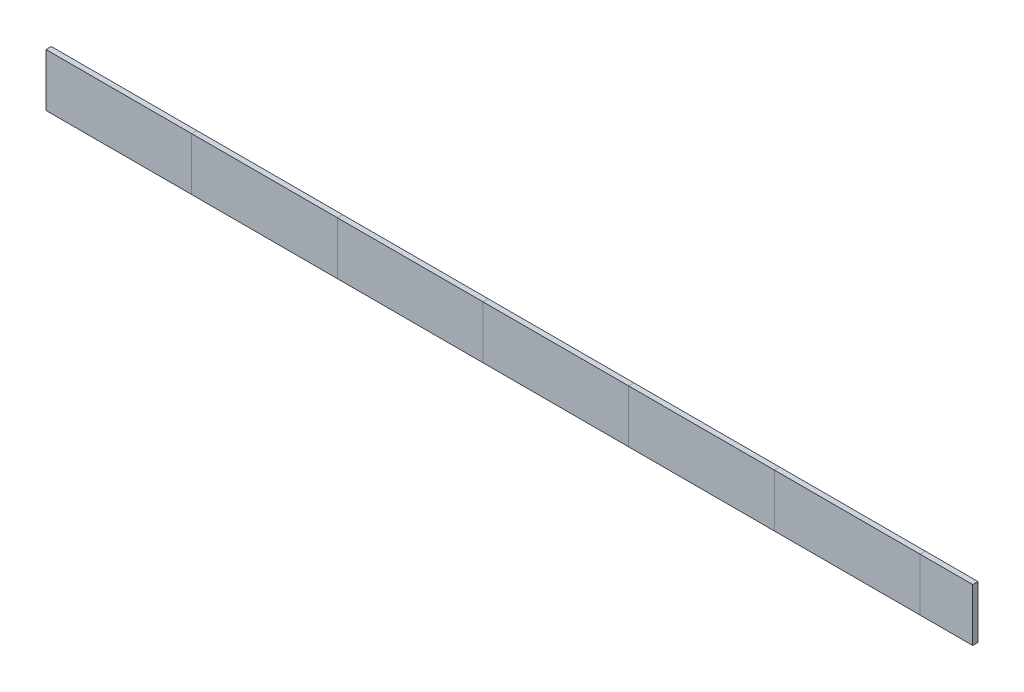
ISO-10303-21;
HEADER;
FILE_DESCRIPTION(('STEP AP214'),'2;1');
FILE_NAME('part.step','',(''),(''),'','','');
FILE_SCHEMA(('AUTOMOTIVE_DESIGN { 1 0 10303 214 1 1 1 1 }'));
ENDSEC;
DATA;
#1=APPLICATION_CONTEXT('core data for automotive mechanical design processes');
#2=APPLICATION_PROTOCOL_DEFINITION('international standard','automotive_design',2000,#1);
#3=PRODUCT_CONTEXT('',#1,'mechanical');
#4=PRODUCT('Part','Part','',(#3));
#5=PRODUCT_RELATED_PRODUCT_CATEGORY('part','',(#4));
#6=PRODUCT_DEFINITION_FORMATION('','',#4);
#7=PRODUCT_DEFINITION_CONTEXT('part definition',#1,'design');
#8=PRODUCT_DEFINITION('design','',#6,#7);
#9=PRODUCT_DEFINITION_SHAPE('','',#8);
#10=(LENGTH_UNIT() NAMED_UNIT(*) SI_UNIT(.MILLI.,.METRE.));
#11=(NAMED_UNIT(*) PLANE_ANGLE_UNIT() SI_UNIT($,.RADIAN.));
#12=(NAMED_UNIT(*) SI_UNIT($,.STERADIAN.) SOLID_ANGLE_UNIT());
#13=UNCERTAINTY_MEASURE_WITH_UNIT(LENGTH_MEASURE(1.E-05),#10,'distance_accuracy_value','');
#14=(GEOMETRIC_REPRESENTATION_CONTEXT(3) GLOBAL_UNCERTAINTY_ASSIGNED_CONTEXT((#13)) GLOBAL_UNIT_ASSIGNED_CONTEXT((#10,
#11,#12)) REPRESENTATION_CONTEXT('',''));
#15=CARTESIAN_POINT('',(0.,0.,0.));
#16=DIRECTION('',(0.,0.,1.));
#17=DIRECTION('',(1.,0.,0.));
#18=AXIS2_PLACEMENT_3D('',#15,#16,#17);
#19=CARTESIAN_POINT('',(0.,5.,0.));
#20=DIRECTION('',(0.,-1.,0.));
#21=DIRECTION('',(-1.,0.,0.));
#22=AXIS2_PLACEMENT_3D('',#19,#20,#21);
#23=PLANE('',#22);
#24=DIRECTION('',(0.,0.,1.));
#25=VECTOR('',#24,1.);
#26=CARTESIAN_POINT('',(27.6,5.,0.));
#27=LINE('',#26,#25);
#28=CARTESIAN_POINT('',(27.6,5.,-0.5));
#29=VERTEX_POINT('',#28);
#30=CARTESIAN_POINT('',(27.6,5.,0.5));
#31=VERTEX_POINT('',#30);
#32=EDGE_CURVE('E12',#29,#31,#27,.T.);
#33=ORIENTED_EDGE('',*,*,#32,.F.);
#34=DIRECTION('',(-1.,0.,0.));
#35=VECTOR('',#34,1.);
#36=CARTESIAN_POINT('',(0.,5.,-0.5));
#37=LINE('',#36,#35);
#38=CARTESIAN_POINT('',(0.,5.,-0.5));
#39=VERTEX_POINT('',#38);
#40=EDGE_CURVE('E110',#29,#39,#37,.T.);
#41=ORIENTED_EDGE('',*,*,#40,.T.);
#42=DIRECTION('',(0.,0.,1.));
#43=VECTOR('',#42,1.);
#44=CARTESIAN_POINT('',(0.,5.,0.));
#45=LINE('',#44,#43);
#46=CARTESIAN_POINT('',(0.,5.,0.5));
#47=VERTEX_POINT('',#46);
#48=EDGE_CURVE('E65',#39,#47,#45,.T.);
#49=ORIENTED_EDGE('',*,*,#48,.T.);
#50=DIRECTION('',(-1.,0.,0.));
#51=VECTOR('',#50,1.);
#52=CARTESIAN_POINT('',(0.,5.,0.5));
#53=LINE('',#52,#51);
#54=EDGE_CURVE('E123',#31,#47,#53,.T.);
#55=ORIENTED_EDGE('',*,*,#54,.F.);
#56=EDGE_LOOP('',(#33,#41,#49,#55));
#57=FACE_BOUND('',#56,.T.);
#58=ADVANCED_FACE('F55',(#57),#23,.F.);
#59=CARTESIAN_POINT('',(0.,0.,0.));
#60=DIRECTION('',(-1.,0.,0.));
#61=DIRECTION('',(0.,1.,0.));
#62=AXIS2_PLACEMENT_3D('',#59,#60,#61);
#63=PLANE('',#62);
#64=ORIENTED_EDGE('',*,*,#48,.F.);
#65=DIRECTION('',(0.,1.,0.));
#66=VECTOR('',#65,1.);
#67=CARTESIAN_POINT('',(0.,0.,-0.5));
#68=LINE('',#67,#66);
#69=CARTESIAN_POINT('',(0.,-5.,-0.5));
#70=VERTEX_POINT('',#69);
#71=EDGE_CURVE('E117',#39,#70,#68,.F.);
#72=ORIENTED_EDGE('',*,*,#71,.T.);
#73=DIRECTION('',(0.,0.,1.));
#74=VECTOR('',#73,1.);
#75=CARTESIAN_POINT('',(0.,-5.,0.));
#76=LINE('',#75,#74);
#77=CARTESIAN_POINT('',(0.,-5.,0.5));
#78=VERTEX_POINT('',#77);
#79=EDGE_CURVE('E73',#70,#78,#76,.T.);
#80=ORIENTED_EDGE('',*,*,#79,.T.);
#81=DIRECTION('',(0.,1.,0.));
#82=VECTOR('',#81,1.);
#83=CARTESIAN_POINT('',(0.,0.,0.5));
#84=LINE('',#83,#82);
#85=EDGE_CURVE('E104',#47,#78,#84,.F.);
#86=ORIENTED_EDGE('',*,*,#85,.F.);
#87=EDGE_LOOP('',(#64,#72,#80,#86));
#88=FACE_BOUND('',#87,.T.);
#89=ADVANCED_FACE('F127',(#88),#63,.T.);
#90=CARTESIAN_POINT('',(0.,-5.,0.));
#91=DIRECTION('',(0.,-1.,0.));
#92=DIRECTION('',(-1.,0.,0.));
#93=AXIS2_PLACEMENT_3D('',#90,#91,#92);
#94=PLANE('',#93);
#95=ORIENTED_EDGE('',*,*,#79,.F.);
#96=DIRECTION('',(-1.,0.,0.));
#97=VECTOR('',#96,1.);
#98=CARTESIAN_POINT('',(0.,-5.,-0.5));
#99=LINE('',#98,#97);
#100=CARTESIAN_POINT('',(27.6,-4.99999999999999,-0.5));
#101=VERTEX_POINT('',#100);
#102=EDGE_CURVE('E109',#70,#101,#99,.F.);
#103=ORIENTED_EDGE('',*,*,#102,.T.);
#104=DIRECTION('',(0.,0.,1.));
#105=VECTOR('',#104,1.);
#106=CARTESIAN_POINT('',(27.6,-4.99999999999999,0.));
#107=LINE('',#106,#105);
#108=CARTESIAN_POINT('',(27.6,-4.99999999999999,0.5));
#109=VERTEX_POINT('',#108);
#110=EDGE_CURVE('E59',#101,#109,#107,.T.);
#111=ORIENTED_EDGE('',*,*,#110,.T.);
#112=DIRECTION('',(-1.,0.,0.));
#113=VECTOR('',#112,1.);
#114=CARTESIAN_POINT('',(0.,-5.,0.5));
#115=LINE('',#114,#113);
#116=EDGE_CURVE('E119',#78,#109,#115,.F.);
#117=ORIENTED_EDGE('',*,*,#116,.F.);
#118=EDGE_LOOP('',(#95,#103,#111,#117));
#119=FACE_BOUND('',#118,.T.);
#120=ADVANCED_FACE('F112',(#119),#94,.T.);
#121=CARTESIAN_POINT('',(27.6,0.,0.));
#122=DIRECTION('',(-1.,0.,0.));
#123=DIRECTION('',(0.,1.,0.));
#124=AXIS2_PLACEMENT_3D('',#121,#122,#123);
#125=PLANE('',#124);
#126=DIRECTION('',(0.,1.,0.));
#127=VECTOR('',#126,1.);
#128=CARTESIAN_POINT('',(27.6,0.,-0.5));
#129=LINE('',#128,#127);
#130=EDGE_CURVE('E98',#101,#29,#129,.T.);
#131=ORIENTED_EDGE('',*,*,#130,.T.);
#132=ORIENTED_EDGE('',*,*,#32,.T.);
#133=DIRECTION('',(0.,1.,0.));
#134=VECTOR('',#133,1.);
#135=CARTESIAN_POINT('',(27.6,0.,0.5));
#136=LINE('',#135,#134);
#137=EDGE_CURVE('E100',#109,#31,#136,.T.);
#138=ORIENTED_EDGE('',*,*,#137,.F.);
#139=ORIENTED_EDGE('',*,*,#110,.F.);
#140=EDGE_LOOP('',(#131,#132,#138,#139));
#141=FACE_BOUND('',#140,.T.);
#142=ADVANCED_FACE('F57',(#141),#125,.F.);
#143=CARTESIAN_POINT('',(0.,0.,0.5));
#144=DIRECTION('',(0.,0.,-1.));
#145=DIRECTION('',(-1.,0.,0.));
#146=AXIS2_PLACEMENT_3D('',#143,#144,#145);
#147=PLANE('',#146);
#148=ORIENTED_EDGE('',*,*,#116,.T.);
#149=ORIENTED_EDGE('',*,*,#137,.T.);
#150=ORIENTED_EDGE('',*,*,#54,.T.);
#151=ORIENTED_EDGE('',*,*,#85,.T.);
#152=EDGE_LOOP('',(#148,#149,#150,#151));
#153=FACE_BOUND('',#152,.T.);
#154=ADVANCED_FACE('F126',(#153),#147,.F.);
#155=CARTESIAN_POINT('',(0.,0.,-0.5));
#156=DIRECTION('',(0.,0.,-1.));
#157=DIRECTION('',(-1.,0.,0.));
#158=AXIS2_PLACEMENT_3D('',#155,#156,#157);
#159=PLANE('',#158);
#160=ORIENTED_EDGE('',*,*,#102,.F.);
#161=ORIENTED_EDGE('',*,*,#71,.F.);
#162=ORIENTED_EDGE('',*,*,#40,.F.);
#163=ORIENTED_EDGE('',*,*,#130,.F.);
#164=EDGE_LOOP('',(#160,#161,#162,#163));
#165=FACE_BOUND('',#164,.T.);
#166=ADVANCED_FACE('F107',(#165),#159,.T.);
#167=CLOSED_SHELL('',(#58,#89,#120,#142,#154,#166));
#168=MANIFOLD_SOLID_BREP('B2',#167);
#169=CARTESIAN_POINT('',(0.,5.,0.));
#170=DIRECTION('',(0.,-1.,0.));
#171=DIRECTION('',(-1.,0.,0.));
#172=AXIS2_PLACEMENT_3D('',#169,#170,#171);
#173=PLANE('',#172);
#174=DIRECTION('',(0.,0.,1.));
#175=VECTOR('',#174,1.);
#176=CARTESIAN_POINT('',(165.6,5.,0.));
#177=LINE('',#176,#175);
#178=CARTESIAN_POINT('',(165.6,5.,-0.5));
#179=VERTEX_POINT('',#178);
#180=CARTESIAN_POINT('',(165.6,5.,0.5));
#181=VERTEX_POINT('',#180);
#182=EDGE_CURVE('E53',#179,#181,#177,.T.);
#183=ORIENTED_EDGE('',*,*,#182,.F.);
#184=DIRECTION('',(-1.,0.,0.));
#185=VECTOR('',#184,1.);
#186=CARTESIAN_POINT('',(0.,5.,-0.5));
#187=LINE('',#186,#185);
#188=CARTESIAN_POINT('',(138.,5.,-0.5));
#189=VERTEX_POINT('',#188);
#190=EDGE_CURVE('E243',#179,#189,#187,.T.);
#191=ORIENTED_EDGE('',*,*,#190,.T.);
#192=DIRECTION('',(0.,0.,1.));
#193=VECTOR('',#192,1.);
#194=CARTESIAN_POINT('',(138.,5.,0.));
#195=LINE('',#194,#193);
#196=CARTESIAN_POINT('',(138.,5.,0.5));
#197=VERTEX_POINT('',#196);
#198=EDGE_CURVE('E198',#189,#197,#195,.T.);
#199=ORIENTED_EDGE('',*,*,#198,.T.);
#200=DIRECTION('',(-1.,0.,0.));
#201=VECTOR('',#200,1.);
#202=CARTESIAN_POINT('',(0.,5.,0.5));
#203=LINE('',#202,#201);
#204=EDGE_CURVE('E256',#181,#197,#203,.T.);
#205=ORIENTED_EDGE('',*,*,#204,.F.);
#206=EDGE_LOOP('',(#183,#191,#199,#205));
#207=FACE_BOUND('',#206,.T.);
#208=ADVANCED_FACE('F188',(#207),#173,.F.);
#209=CARTESIAN_POINT('',(138.,0.,0.));
#210=DIRECTION('',(-1.,0.,0.));
#211=DIRECTION('',(0.,1.,0.));
#212=AXIS2_PLACEMENT_3D('',#209,#210,#211);
#213=PLANE('',#212);
#214=ORIENTED_EDGE('',*,*,#198,.F.);
#215=DIRECTION('',(0.,1.,0.));
#216=VECTOR('',#215,1.);
#217=CARTESIAN_POINT('',(138.,0.,-0.5));
#218=LINE('',#217,#216);
#219=CARTESIAN_POINT('',(138.,-4.99999999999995,-0.5));
#220=VERTEX_POINT('',#219);
#221=EDGE_CURVE('E250',#220,#189,#218,.T.);
#222=ORIENTED_EDGE('',*,*,#221,.F.);
#223=DIRECTION('',(0.,0.,1.));
#224=VECTOR('',#223,1.);
#225=CARTESIAN_POINT('',(138.,-4.99999999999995,0.));
#226=LINE('',#225,#224);
#227=CARTESIAN_POINT('',(138.,-4.99999999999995,0.5));
#228=VERTEX_POINT('',#227);
#229=EDGE_CURVE('E206',#220,#228,#226,.T.);
#230=ORIENTED_EDGE('',*,*,#229,.T.);
#231=DIRECTION('',(0.,1.,0.));
#232=VECTOR('',#231,1.);
#233=CARTESIAN_POINT('',(138.,0.,0.5));
#234=LINE('',#233,#232);
#235=EDGE_CURVE('E237',#228,#197,#234,.T.);
#236=ORIENTED_EDGE('',*,*,#235,.T.);
#237=EDGE_LOOP('',(#214,#222,#230,#236));
#238=FACE_BOUND('',#237,.T.);
#239=ADVANCED_FACE('F260',(#238),#213,.T.);
#240=CARTESIAN_POINT('',(0.,-4.99999999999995,0.));
#241=DIRECTION('',(0.,-1.,0.));
#242=DIRECTION('',(-1.,0.,0.));
#243=AXIS2_PLACEMENT_3D('',#240,#241,#242);
#244=PLANE('',#243);
#245=ORIENTED_EDGE('',*,*,#229,.F.);
#246=DIRECTION('',(-1.,0.,0.));
#247=VECTOR('',#246,1.);
#248=CARTESIAN_POINT('',(0.,-4.99999999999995,-0.5));
#249=LINE('',#248,#247);
#250=CARTESIAN_POINT('',(165.6,-4.99999999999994,-0.5));
#251=VERTEX_POINT('',#250);
#252=EDGE_CURVE('E242',#220,#251,#249,.F.);
#253=ORIENTED_EDGE('',*,*,#252,.T.);
#254=DIRECTION('',(0.,0.,1.));
#255=VECTOR('',#254,1.);
#256=CARTESIAN_POINT('',(165.6,-4.99999999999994,0.));
#257=LINE('',#256,#255);
#258=CARTESIAN_POINT('',(165.6,-4.99999999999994,0.5));
#259=VERTEX_POINT('',#258);
#260=EDGE_CURVE('E192',#251,#259,#257,.T.);
#261=ORIENTED_EDGE('',*,*,#260,.T.);
#262=DIRECTION('',(-1.,0.,0.));
#263=VECTOR('',#262,1.);
#264=CARTESIAN_POINT('',(0.,-4.99999999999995,0.5));
#265=LINE('',#264,#263);
#266=EDGE_CURVE('E252',#228,#259,#265,.F.);
#267=ORIENTED_EDGE('',*,*,#266,.F.);
#268=EDGE_LOOP('',(#245,#253,#261,#267));
#269=FACE_BOUND('',#268,.T.);
#270=ADVANCED_FACE('F245',(#269),#244,.T.);
#271=CARTESIAN_POINT('',(165.6,0.,0.));
#272=DIRECTION('',(-1.,0.,0.));
#273=DIRECTION('',(0.,1.,0.));
#274=AXIS2_PLACEMENT_3D('',#271,#272,#273);
#275=PLANE('',#274);
#276=DIRECTION('',(0.,1.,0.));
#277=VECTOR('',#276,1.);
#278=CARTESIAN_POINT('',(165.6,0.,-0.5));
#279=LINE('',#278,#277);
#280=EDGE_CURVE('E231',#251,#179,#279,.T.);
#281=ORIENTED_EDGE('',*,*,#280,.T.);
#282=ORIENTED_EDGE('',*,*,#182,.T.);
#283=DIRECTION('',(0.,1.,0.));
#284=VECTOR('',#283,1.);
#285=CARTESIAN_POINT('',(165.6,0.,0.5));
#286=LINE('',#285,#284);
#287=EDGE_CURVE('E233',#259,#181,#286,.T.);
#288=ORIENTED_EDGE('',*,*,#287,.F.);
#289=ORIENTED_EDGE('',*,*,#260,.F.);
#290=EDGE_LOOP('',(#281,#282,#288,#289));
#291=FACE_BOUND('',#290,.T.);
#292=ADVANCED_FACE('F190',(#291),#275,.F.);
#293=CARTESIAN_POINT('',(0.,0.,0.5));
#294=DIRECTION('',(0.,0.,-1.));
#295=DIRECTION('',(-1.,0.,0.));
#296=AXIS2_PLACEMENT_3D('',#293,#294,#295);
#297=PLANE('',#296);
#298=ORIENTED_EDGE('',*,*,#266,.T.);
#299=ORIENTED_EDGE('',*,*,#287,.T.);
#300=ORIENTED_EDGE('',*,*,#204,.T.);
#301=ORIENTED_EDGE('',*,*,#235,.F.);
#302=EDGE_LOOP('',(#298,#299,#300,#301));
#303=FACE_BOUND('',#302,.T.);
#304=ADVANCED_FACE('F259',(#303),#297,.F.);
#305=CARTESIAN_POINT('',(0.,0.,-0.5));
#306=DIRECTION('',(0.,0.,-1.));
#307=DIRECTION('',(-1.,0.,0.));
#308=AXIS2_PLACEMENT_3D('',#305,#306,#307);
#309=PLANE('',#308);
#310=ORIENTED_EDGE('',*,*,#252,.F.);
#311=ORIENTED_EDGE('',*,*,#221,.T.);
#312=ORIENTED_EDGE('',*,*,#190,.F.);
#313=ORIENTED_EDGE('',*,*,#280,.F.);
#314=EDGE_LOOP('',(#310,#311,#312,#313));
#315=FACE_BOUND('',#314,.T.);
#316=ADVANCED_FACE('F240',(#315),#309,.T.);
#317=CLOSED_SHELL('',(#208,#239,#270,#292,#304,#316));
#318=MANIFOLD_SOLID_BREP('B6',#317);
#319=CARTESIAN_POINT('',(0.,5.,0.));
#320=DIRECTION('',(0.,-1.,0.));
#321=DIRECTION('',(-1.,0.,0.));
#322=AXIS2_PLACEMENT_3D('',#319,#320,#321);
#323=PLANE('',#322);
#324=DIRECTION('',(0.,0.,1.));
#325=VECTOR('',#324,1.);
#326=CARTESIAN_POINT('',(110.4,5.,0.));
#327=LINE('',#326,#325);
#328=CARTESIAN_POINT('',(110.4,5.,-0.5));
#329=VERTEX_POINT('',#328);
#330=CARTESIAN_POINT('',(110.4,5.,0.5));
#331=VERTEX_POINT('',#330);
#332=EDGE_CURVE('E186',#329,#331,#327,.T.);
#333=ORIENTED_EDGE('',*,*,#332,.F.);
#334=DIRECTION('',(-1.,0.,0.));
#335=VECTOR('',#334,1.);
#336=CARTESIAN_POINT('',(0.,5.,-0.5));
#337=LINE('',#336,#335);
#338=CARTESIAN_POINT('',(82.8,5.,-0.5));
#339=VERTEX_POINT('',#338);
#340=EDGE_CURVE('E376',#329,#339,#337,.T.);
#341=ORIENTED_EDGE('',*,*,#340,.T.);
#342=DIRECTION('',(0.,0.,1.));
#343=VECTOR('',#342,1.);
#344=CARTESIAN_POINT('',(82.8,5.,0.));
#345=LINE('',#344,#343);
#346=CARTESIAN_POINT('',(82.8,5.,0.5));
#347=VERTEX_POINT('',#346);
#348=EDGE_CURVE('E331',#339,#347,#345,.T.);
#349=ORIENTED_EDGE('',*,*,#348,.T.);
#350=DIRECTION('',(-1.,0.,0.));
#351=VECTOR('',#350,1.);
#352=CARTESIAN_POINT('',(0.,5.,0.5));
#353=LINE('',#352,#351);
#354=EDGE_CURVE('E389',#331,#347,#353,.T.);
#355=ORIENTED_EDGE('',*,*,#354,.F.);
#356=EDGE_LOOP('',(#333,#341,#349,#355));
#357=FACE_BOUND('',#356,.T.);
#358=ADVANCED_FACE('F321',(#357),#323,.F.);
#359=CARTESIAN_POINT('',(82.8,0.,0.));
#360=DIRECTION('',(-1.,0.,0.));
#361=DIRECTION('',(0.,1.,0.));
#362=AXIS2_PLACEMENT_3D('',#359,#360,#361);
#363=PLANE('',#362);
#364=ORIENTED_EDGE('',*,*,#348,.F.);
#365=DIRECTION('',(0.,1.,0.));
#366=VECTOR('',#365,1.);
#367=CARTESIAN_POINT('',(82.8,0.,-0.5));
#368=LINE('',#367,#366);
#369=CARTESIAN_POINT('',(82.8,-4.99999999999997,-0.5));
#370=VERTEX_POINT('',#369);
#371=EDGE_CURVE('E383',#370,#339,#368,.T.);
#372=ORIENTED_EDGE('',*,*,#371,.F.);
#373=DIRECTION('',(0.,0.,1.));
#374=VECTOR('',#373,1.);
#375=CARTESIAN_POINT('',(82.8,-4.99999999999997,0.));
#376=LINE('',#375,#374);
#377=CARTESIAN_POINT('',(82.8,-4.99999999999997,0.5));
#378=VERTEX_POINT('',#377);
#379=EDGE_CURVE('E339',#370,#378,#376,.T.);
#380=ORIENTED_EDGE('',*,*,#379,.T.);
#381=DIRECTION('',(0.,1.,0.));
#382=VECTOR('',#381,1.);
#383=CARTESIAN_POINT('',(82.8,0.,0.5));
#384=LINE('',#383,#382);
#385=EDGE_CURVE('E370',#378,#347,#384,.T.);
#386=ORIENTED_EDGE('',*,*,#385,.T.);
#387=EDGE_LOOP('',(#364,#372,#380,#386));
#388=FACE_BOUND('',#387,.T.);
#389=ADVANCED_FACE('F393',(#388),#363,.T.);
#390=CARTESIAN_POINT('',(0.,-4.99999999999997,0.));
#391=DIRECTION('',(0.,-1.,0.));
#392=DIRECTION('',(-1.,0.,0.));
#393=AXIS2_PLACEMENT_3D('',#390,#391,#392);
#394=PLANE('',#393);
#395=ORIENTED_EDGE('',*,*,#379,.F.);
#396=DIRECTION('',(-1.,0.,0.));
#397=VECTOR('',#396,1.);
#398=CARTESIAN_POINT('',(0.,-4.99999999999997,-0.5));
#399=LINE('',#398,#397);
#400=CARTESIAN_POINT('',(110.4,-4.99999999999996,-0.5));
#401=VERTEX_POINT('',#400);
#402=EDGE_CURVE('E375',#370,#401,#399,.F.);
#403=ORIENTED_EDGE('',*,*,#402,.T.);
#404=DIRECTION('',(0.,0.,1.));
#405=VECTOR('',#404,1.);
#406=CARTESIAN_POINT('',(110.4,-4.99999999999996,0.));
#407=LINE('',#406,#405);
#408=CARTESIAN_POINT('',(110.4,-4.99999999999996,0.5));
#409=VERTEX_POINT('',#408);
#410=EDGE_CURVE('E325',#401,#409,#407,.T.);
#411=ORIENTED_EDGE('',*,*,#410,.T.);
#412=DIRECTION('',(-1.,0.,0.));
#413=VECTOR('',#412,1.);
#414=CARTESIAN_POINT('',(0.,-4.99999999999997,0.5));
#415=LINE('',#414,#413);
#416=EDGE_CURVE('E385',#378,#409,#415,.F.);
#417=ORIENTED_EDGE('',*,*,#416,.F.);
#418=EDGE_LOOP('',(#395,#403,#411,#417));
#419=FACE_BOUND('',#418,.T.);
#420=ADVANCED_FACE('F378',(#419),#394,.T.);
#421=CARTESIAN_POINT('',(110.4,0.,0.));
#422=DIRECTION('',(-1.,0.,0.));
#423=DIRECTION('',(0.,1.,0.));
#424=AXIS2_PLACEMENT_3D('',#421,#422,#423);
#425=PLANE('',#424);
#426=DIRECTION('',(0.,1.,0.));
#427=VECTOR('',#426,1.);
#428=CARTESIAN_POINT('',(110.4,0.,-0.5));
#429=LINE('',#428,#427);
#430=EDGE_CURVE('E364',#401,#329,#429,.T.);
#431=ORIENTED_EDGE('',*,*,#430,.T.);
#432=ORIENTED_EDGE('',*,*,#332,.T.);
#433=DIRECTION('',(0.,1.,0.));
#434=VECTOR('',#433,1.);
#435=CARTESIAN_POINT('',(110.4,0.,0.5));
#436=LINE('',#435,#434);
#437=EDGE_CURVE('E366',#409,#331,#436,.T.);
#438=ORIENTED_EDGE('',*,*,#437,.F.);
#439=ORIENTED_EDGE('',*,*,#410,.F.);
#440=EDGE_LOOP('',(#431,#432,#438,#439));
#441=FACE_BOUND('',#440,.T.);
#442=ADVANCED_FACE('F323',(#441),#425,.F.);
#443=CARTESIAN_POINT('',(0.,0.,0.5));
#444=DIRECTION('',(0.,0.,-1.));
#445=DIRECTION('',(-1.,0.,0.));
#446=AXIS2_PLACEMENT_3D('',#443,#444,#445);
#447=PLANE('',#446);
#448=ORIENTED_EDGE('',*,*,#416,.T.);
#449=ORIENTED_EDGE('',*,*,#437,.T.);
#450=ORIENTED_EDGE('',*,*,#354,.T.);
#451=ORIENTED_EDGE('',*,*,#385,.F.);
#452=EDGE_LOOP('',(#448,#449,#450,#451));
#453=FACE_BOUND('',#452,.T.);
#454=ADVANCED_FACE('F392',(#453),#447,.F.);
#455=CARTESIAN_POINT('',(0.,0.,-0.5));
#456=DIRECTION('',(0.,0.,-1.));
#457=DIRECTION('',(-1.,0.,0.));
#458=AXIS2_PLACEMENT_3D('',#455,#456,#457);
#459=PLANE('',#458);
#460=ORIENTED_EDGE('',*,*,#402,.F.);
#461=ORIENTED_EDGE('',*,*,#371,.T.);
#462=ORIENTED_EDGE('',*,*,#340,.F.);
#463=ORIENTED_EDGE('',*,*,#430,.F.);
#464=EDGE_LOOP('',(#460,#461,#462,#463));
#465=FACE_BOUND('',#464,.T.);
#466=ADVANCED_FACE('F373',(#465),#459,.T.);
#467=CLOSED_SHELL('',(#358,#389,#420,#442,#454,#466));
#468=MANIFOLD_SOLID_BREP('B47',#467);
#469=CARTESIAN_POINT('',(0.,5.,0.));
#470=DIRECTION('',(0.,-1.,0.));
#471=DIRECTION('',(-1.,0.,0.));
#472=AXIS2_PLACEMENT_3D('',#469,#470,#471);
#473=PLANE('',#472);
#474=DIRECTION('',(0.,0.,1.));
#475=VECTOR('',#474,1.);
#476=CARTESIAN_POINT('',(138.,5.,0.));
#477=LINE('',#476,#475);
#478=CARTESIAN_POINT('',(138.,5.,-0.5));
#479=VERTEX_POINT('',#478);
#480=CARTESIAN_POINT('',(138.,5.,0.5));
#481=VERTEX_POINT('',#480);
#482=EDGE_CURVE('E319',#479,#481,#477,.T.);
#483=ORIENTED_EDGE('',*,*,#482,.F.);
#484=DIRECTION('',(-1.,0.,0.));
#485=VECTOR('',#484,1.);
#486=CARTESIAN_POINT('',(0.,5.,-0.5));
#487=LINE('',#486,#485);
#488=CARTESIAN_POINT('',(110.4,5.,-0.5));
#489=VERTEX_POINT('',#488);
#490=EDGE_CURVE('E509',#479,#489,#487,.T.);
#491=ORIENTED_EDGE('',*,*,#490,.T.);
#492=DIRECTION('',(0.,0.,1.));
#493=VECTOR('',#492,1.);
#494=CARTESIAN_POINT('',(110.4,5.,0.));
#495=LINE('',#494,#493);
#496=CARTESIAN_POINT('',(110.4,5.,0.5));
#497=VERTEX_POINT('',#496);
#498=EDGE_CURVE('E464',#489,#497,#495,.T.);
#499=ORIENTED_EDGE('',*,*,#498,.T.);
#500=DIRECTION('',(-1.,0.,0.));
#501=VECTOR('',#500,1.);
#502=CARTESIAN_POINT('',(0.,5.,0.5));
#503=LINE('',#502,#501);
#504=EDGE_CURVE('E522',#481,#497,#503,.T.);
#505=ORIENTED_EDGE('',*,*,#504,.F.);
#506=EDGE_LOOP('',(#483,#491,#499,#505));
#507=FACE_BOUND('',#506,.T.);
#508=ADVANCED_FACE('F454',(#507),#473,.F.);
#509=CARTESIAN_POINT('',(110.4,0.,0.));
#510=DIRECTION('',(-1.,0.,0.));
#511=DIRECTION('',(0.,1.,0.));
#512=AXIS2_PLACEMENT_3D('',#509,#510,#511);
#513=PLANE('',#512);
#514=ORIENTED_EDGE('',*,*,#498,.F.);
#515=DIRECTION('',(0.,1.,0.));
#516=VECTOR('',#515,1.);
#517=CARTESIAN_POINT('',(110.4,0.,-0.5));
#518=LINE('',#517,#516);
#519=CARTESIAN_POINT('',(110.4,-4.99999999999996,-0.5));
#520=VERTEX_POINT('',#519);
#521=EDGE_CURVE('E516',#520,#489,#518,.T.);
#522=ORIENTED_EDGE('',*,*,#521,.F.);
#523=DIRECTION('',(0.,0.,1.));
#524=VECTOR('',#523,1.);
#525=CARTESIAN_POINT('',(110.4,-4.99999999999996,0.));
#526=LINE('',#525,#524);
#527=CARTESIAN_POINT('',(110.4,-4.99999999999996,0.5));
#528=VERTEX_POINT('',#527);
#529=EDGE_CURVE('E472',#520,#528,#526,.T.);
#530=ORIENTED_EDGE('',*,*,#529,.T.);
#531=DIRECTION('',(0.,1.,0.));
#532=VECTOR('',#531,1.);
#533=CARTESIAN_POINT('',(110.4,0.,0.5));
#534=LINE('',#533,#532);
#535=EDGE_CURVE('E503',#528,#497,#534,.T.);
#536=ORIENTED_EDGE('',*,*,#535,.T.);
#537=EDGE_LOOP('',(#514,#522,#530,#536));
#538=FACE_BOUND('',#537,.T.);
#539=ADVANCED_FACE('F526',(#538),#513,.T.);
#540=CARTESIAN_POINT('',(0.,-4.99999999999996,0.));
#541=DIRECTION('',(0.,-1.,0.));
#542=DIRECTION('',(-1.,0.,0.));
#543=AXIS2_PLACEMENT_3D('',#540,#541,#542);
#544=PLANE('',#543);
#545=ORIENTED_EDGE('',*,*,#529,.F.);
#546=DIRECTION('',(-1.,0.,0.));
#547=VECTOR('',#546,1.);
#548=CARTESIAN_POINT('',(0.,-4.99999999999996,-0.5));
#549=LINE('',#548,#547);
#550=CARTESIAN_POINT('',(138.,-4.99999999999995,-0.5));
#551=VERTEX_POINT('',#550);
#552=EDGE_CURVE('E508',#520,#551,#549,.F.);
#553=ORIENTED_EDGE('',*,*,#552,.T.);
#554=DIRECTION('',(0.,0.,1.));
#555=VECTOR('',#554,1.);
#556=CARTESIAN_POINT('',(138.,-4.99999999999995,0.));
#557=LINE('',#556,#555);
#558=CARTESIAN_POINT('',(138.,-4.99999999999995,0.5));
#559=VERTEX_POINT('',#558);
#560=EDGE_CURVE('E458',#551,#559,#557,.T.);
#561=ORIENTED_EDGE('',*,*,#560,.T.);
#562=DIRECTION('',(-1.,0.,0.));
#563=VECTOR('',#562,1.);
#564=CARTESIAN_POINT('',(0.,-4.99999999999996,0.5));
#565=LINE('',#564,#563);
#566=EDGE_CURVE('E518',#528,#559,#565,.F.);
#567=ORIENTED_EDGE('',*,*,#566,.F.);
#568=EDGE_LOOP('',(#545,#553,#561,#567));
#569=FACE_BOUND('',#568,.T.);
#570=ADVANCED_FACE('F511',(#569),#544,.T.);
#571=CARTESIAN_POINT('',(138.,0.,0.));
#572=DIRECTION('',(-1.,0.,0.));
#573=DIRECTION('',(0.,1.,0.));
#574=AXIS2_PLACEMENT_3D('',#571,#572,#573);
#575=PLANE('',#574);
#576=DIRECTION('',(0.,1.,0.));
#577=VECTOR('',#576,1.);
#578=CARTESIAN_POINT('',(138.,0.,-0.5));
#579=LINE('',#578,#577);
#580=EDGE_CURVE('E497',#551,#479,#579,.T.);
#581=ORIENTED_EDGE('',*,*,#580,.T.);
#582=ORIENTED_EDGE('',*,*,#482,.T.);
#583=DIRECTION('',(0.,1.,0.));
#584=VECTOR('',#583,1.);
#585=CARTESIAN_POINT('',(138.,0.,0.5));
#586=LINE('',#585,#584);
#587=EDGE_CURVE('E499',#559,#481,#586,.T.);
#588=ORIENTED_EDGE('',*,*,#587,.F.);
#589=ORIENTED_EDGE('',*,*,#560,.F.);
#590=EDGE_LOOP('',(#581,#582,#588,#589));
#591=FACE_BOUND('',#590,.T.);
#592=ADVANCED_FACE('F456',(#591),#575,.F.);
#593=CARTESIAN_POINT('',(0.,0.,0.5));
#594=DIRECTION('',(0.,0.,-1.));
#595=DIRECTION('',(-1.,0.,0.));
#596=AXIS2_PLACEMENT_3D('',#593,#594,#595);
#597=PLANE('',#596);
#598=ORIENTED_EDGE('',*,*,#566,.T.);
#599=ORIENTED_EDGE('',*,*,#587,.T.);
#600=ORIENTED_EDGE('',*,*,#504,.T.);
#601=ORIENTED_EDGE('',*,*,#535,.F.);
#602=EDGE_LOOP('',(#598,#599,#600,#601));
#603=FACE_BOUND('',#602,.T.);
#604=ADVANCED_FACE('F525',(#603),#597,.F.);
#605=CARTESIAN_POINT('',(0.,0.,-0.5));
#606=DIRECTION('',(0.,0.,-1.));
#607=DIRECTION('',(-1.,0.,0.));
#608=AXIS2_PLACEMENT_3D('',#605,#606,#607);
#609=PLANE('',#608);
#610=ORIENTED_EDGE('',*,*,#552,.F.);
#611=ORIENTED_EDGE('',*,*,#521,.T.);
#612=ORIENTED_EDGE('',*,*,#490,.F.);
#613=ORIENTED_EDGE('',*,*,#580,.F.);
#614=EDGE_LOOP('',(#610,#611,#612,#613));
#615=FACE_BOUND('',#614,.T.);
#616=ADVANCED_FACE('F506',(#615),#609,.T.);
#617=CLOSED_SHELL('',(#508,#539,#570,#592,#604,#616));
#618=MANIFOLD_SOLID_BREP('B180',#617);
#619=CARTESIAN_POINT('',(0.,5.,0.));
#620=DIRECTION('',(0.,-1.,0.));
#621=DIRECTION('',(-1.,0.,0.));
#622=AXIS2_PLACEMENT_3D('',#619,#620,#621);
#623=PLANE('',#622);
#624=DIRECTION('',(0.,0.,1.));
#625=VECTOR('',#624,1.);
#626=CARTESIAN_POINT('',(82.8,5.,0.));
#627=LINE('',#626,#625);
#628=CARTESIAN_POINT('',(82.8,5.,-0.5));
#629=VERTEX_POINT('',#628);
#630=CARTESIAN_POINT('',(82.8,5.,0.5));
#631=VERTEX_POINT('',#630);
#632=EDGE_CURVE('E452',#629,#631,#627,.T.);
#633=ORIENTED_EDGE('',*,*,#632,.F.);
#634=DIRECTION('',(-1.,0.,0.));
#635=VECTOR('',#634,1.);
#636=CARTESIAN_POINT('',(0.,5.,-0.5));
#637=LINE('',#636,#635);
#638=CARTESIAN_POINT('',(55.2,5.,-0.5));
#639=VERTEX_POINT('',#638);
#640=EDGE_CURVE('E642',#629,#639,#637,.T.);
#641=ORIENTED_EDGE('',*,*,#640,.T.);
#642=DIRECTION('',(0.,0.,1.));
#643=VECTOR('',#642,1.);
#644=CARTESIAN_POINT('',(55.2,5.,0.));
#645=LINE('',#644,#643);
#646=CARTESIAN_POINT('',(55.2,5.,0.5));
#647=VERTEX_POINT('',#646);
#648=EDGE_CURVE('E597',#639,#647,#645,.T.);
#649=ORIENTED_EDGE('',*,*,#648,.T.);
#650=DIRECTION('',(-1.,0.,0.));
#651=VECTOR('',#650,1.);
#652=CARTESIAN_POINT('',(0.,5.,0.5));
#653=LINE('',#652,#651);
#654=EDGE_CURVE('E655',#631,#647,#653,.T.);
#655=ORIENTED_EDGE('',*,*,#654,.F.);
#656=EDGE_LOOP('',(#633,#641,#649,#655));
#657=FACE_BOUND('',#656,.T.);
#658=ADVANCED_FACE('F587',(#657),#623,.F.);
#659=CARTESIAN_POINT('',(55.2,0.,0.));
#660=DIRECTION('',(-1.,0.,0.));
#661=DIRECTION('',(0.,1.,0.));
#662=AXIS2_PLACEMENT_3D('',#659,#660,#661);
#663=PLANE('',#662);
#664=ORIENTED_EDGE('',*,*,#648,.F.);
#665=DIRECTION('',(0.,1.,0.));
#666=VECTOR('',#665,1.);
#667=CARTESIAN_POINT('',(55.2,0.,-0.5));
#668=LINE('',#667,#666);
#669=CARTESIAN_POINT('',(55.2,-4.99999999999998,-0.5));
#670=VERTEX_POINT('',#669);
#671=EDGE_CURVE('E649',#670,#639,#668,.T.);
#672=ORIENTED_EDGE('',*,*,#671,.F.);
#673=DIRECTION('',(0.,0.,1.));
#674=VECTOR('',#673,1.);
#675=CARTESIAN_POINT('',(55.2,-4.99999999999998,0.));
#676=LINE('',#675,#674);
#677=CARTESIAN_POINT('',(55.2,-4.99999999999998,0.5));
#678=VERTEX_POINT('',#677);
#679=EDGE_CURVE('E605',#670,#678,#676,.T.);
#680=ORIENTED_EDGE('',*,*,#679,.T.);
#681=DIRECTION('',(0.,1.,0.));
#682=VECTOR('',#681,1.);
#683=CARTESIAN_POINT('',(55.2,0.,0.5));
#684=LINE('',#683,#682);
#685=EDGE_CURVE('E636',#678,#647,#684,.T.);
#686=ORIENTED_EDGE('',*,*,#685,.T.);
#687=EDGE_LOOP('',(#664,#672,#680,#686));
#688=FACE_BOUND('',#687,.T.);
#689=ADVANCED_FACE('F659',(#688),#663,.T.);
#690=CARTESIAN_POINT('',(0.,-4.99999999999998,0.));
#691=DIRECTION('',(0.,-1.,0.));
#692=DIRECTION('',(-1.,0.,0.));
#693=AXIS2_PLACEMENT_3D('',#690,#691,#692);
#694=PLANE('',#693);
#695=ORIENTED_EDGE('',*,*,#679,.F.);
#696=DIRECTION('',(-1.,0.,0.));
#697=VECTOR('',#696,1.);
#698=CARTESIAN_POINT('',(0.,-4.99999999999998,-0.5));
#699=LINE('',#698,#697);
#700=CARTESIAN_POINT('',(82.8,-4.99999999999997,-0.5));
#701=VERTEX_POINT('',#700);
#702=EDGE_CURVE('E641',#670,#701,#699,.F.);
#703=ORIENTED_EDGE('',*,*,#702,.T.);
#704=DIRECTION('',(0.,0.,1.));
#705=VECTOR('',#704,1.);
#706=CARTESIAN_POINT('',(82.8,-4.99999999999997,0.));
#707=LINE('',#706,#705);
#708=CARTESIAN_POINT('',(82.8,-4.99999999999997,0.5));
#709=VERTEX_POINT('',#708);
#710=EDGE_CURVE('E591',#701,#709,#707,.T.);
#711=ORIENTED_EDGE('',*,*,#710,.T.);
#712=DIRECTION('',(-1.,0.,0.));
#713=VECTOR('',#712,1.);
#714=CARTESIAN_POINT('',(0.,-4.99999999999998,0.5));
#715=LINE('',#714,#713);
#716=EDGE_CURVE('E651',#678,#709,#715,.F.);
#717=ORIENTED_EDGE('',*,*,#716,.F.);
#718=EDGE_LOOP('',(#695,#703,#711,#717));
#719=FACE_BOUND('',#718,.T.);
#720=ADVANCED_FACE('F644',(#719),#694,.T.);
#721=CARTESIAN_POINT('',(82.8,0.,0.));
#722=DIRECTION('',(-1.,0.,0.));
#723=DIRECTION('',(0.,1.,0.));
#724=AXIS2_PLACEMENT_3D('',#721,#722,#723);
#725=PLANE('',#724);
#726=DIRECTION('',(0.,1.,0.));
#727=VECTOR('',#726,1.);
#728=CARTESIAN_POINT('',(82.8,0.,-0.5));
#729=LINE('',#728,#727);
#730=EDGE_CURVE('E630',#701,#629,#729,.T.);
#731=ORIENTED_EDGE('',*,*,#730,.T.);
#732=ORIENTED_EDGE('',*,*,#632,.T.);
#733=DIRECTION('',(0.,1.,0.));
#734=VECTOR('',#733,1.);
#735=CARTESIAN_POINT('',(82.8,0.,0.5));
#736=LINE('',#735,#734);
#737=EDGE_CURVE('E632',#709,#631,#736,.T.);
#738=ORIENTED_EDGE('',*,*,#737,.F.);
#739=ORIENTED_EDGE('',*,*,#710,.F.);
#740=EDGE_LOOP('',(#731,#732,#738,#739));
#741=FACE_BOUND('',#740,.T.);
#742=ADVANCED_FACE('F589',(#741),#725,.F.);
#743=CARTESIAN_POINT('',(0.,0.,0.5));
#744=DIRECTION('',(0.,0.,-1.));
#745=DIRECTION('',(-1.,0.,0.));
#746=AXIS2_PLACEMENT_3D('',#743,#744,#745);
#747=PLANE('',#746);
#748=ORIENTED_EDGE('',*,*,#716,.T.);
#749=ORIENTED_EDGE('',*,*,#737,.T.);
#750=ORIENTED_EDGE('',*,*,#654,.T.);
#751=ORIENTED_EDGE('',*,*,#685,.F.);
#752=EDGE_LOOP('',(#748,#749,#750,#751));
#753=FACE_BOUND('',#752,.T.);
#754=ADVANCED_FACE('F658',(#753),#747,.F.);
#755=CARTESIAN_POINT('',(0.,0.,-0.5));
#756=DIRECTION('',(0.,0.,-1.));
#757=DIRECTION('',(-1.,0.,0.));
#758=AXIS2_PLACEMENT_3D('',#755,#756,#757);
#759=PLANE('',#758);
#760=ORIENTED_EDGE('',*,*,#702,.F.);
#761=ORIENTED_EDGE('',*,*,#671,.T.);
#762=ORIENTED_EDGE('',*,*,#640,.F.);
#763=ORIENTED_EDGE('',*,*,#730,.F.);
#764=EDGE_LOOP('',(#760,#761,#762,#763));
#765=FACE_BOUND('',#764,.T.);
#766=ADVANCED_FACE('F639',(#765),#759,.T.);
#767=CLOSED_SHELL('',(#658,#689,#720,#742,#754,#766));
#768=MANIFOLD_SOLID_BREP('B313',#767);
#769=CARTESIAN_POINT('',(175.6,0.,0.));
#770=DIRECTION('',(-1.,0.,0.));
#771=DIRECTION('',(0.,1.,0.));
#772=AXIS2_PLACEMENT_3D('',#769,#770,#771);
#773=PLANE('',#772);
#774=DIRECTION('',(0.,0.,1.));
#775=VECTOR('',#774,1.);
#776=CARTESIAN_POINT('',(175.6,-4.99999999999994,0.));
#777=LINE('',#776,#775);
#778=CARTESIAN_POINT('',(175.6,-4.99999999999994,-0.5));
#779=VERTEX_POINT('',#778);
#780=CARTESIAN_POINT('',(175.6,-4.99999999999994,0.5));
#781=VERTEX_POINT('',#780);
#782=EDGE_CURVE('E585',#779,#781,#777,.T.);
#783=ORIENTED_EDGE('',*,*,#782,.F.);
#784=DIRECTION('',(0.,1.,0.));
#785=VECTOR('',#784,1.);
#786=CARTESIAN_POINT('',(175.6,0.,-0.5));
#787=LINE('',#786,#785);
#788=CARTESIAN_POINT('',(175.6,5.,-0.5));
#789=VERTEX_POINT('',#788);
#790=EDGE_CURVE('E775',#779,#789,#787,.T.);
#791=ORIENTED_EDGE('',*,*,#790,.T.);
#792=DIRECTION('',(0.,0.,1.));
#793=VECTOR('',#792,1.);
#794=CARTESIAN_POINT('',(175.6,5.,0.));
#795=LINE('',#794,#793);
#796=CARTESIAN_POINT('',(175.6,5.,0.5));
#797=VERTEX_POINT('',#796);
#798=EDGE_CURVE('E730',#789,#797,#795,.T.);
#799=ORIENTED_EDGE('',*,*,#798,.T.);
#800=DIRECTION('',(0.,1.,0.));
#801=VECTOR('',#800,1.);
#802=CARTESIAN_POINT('',(175.6,0.,0.5));
#803=LINE('',#802,#801);
#804=EDGE_CURVE('E788',#781,#797,#803,.T.);
#805=ORIENTED_EDGE('',*,*,#804,.F.);
#806=EDGE_LOOP('',(#783,#791,#799,#805));
#807=FACE_BOUND('',#806,.T.);
#808=ADVANCED_FACE('F720',(#807),#773,.F.);
#809=CARTESIAN_POINT('',(0.,5.,0.));
#810=DIRECTION('',(0.,-1.,0.));
#811=DIRECTION('',(-1.,0.,0.));
#812=AXIS2_PLACEMENT_3D('',#809,#810,#811);
#813=PLANE('',#812);
#814=ORIENTED_EDGE('',*,*,#798,.F.);
#815=DIRECTION('',(-1.,0.,0.));
#816=VECTOR('',#815,1.);
#817=CARTESIAN_POINT('',(0.,5.,-0.5));
#818=LINE('',#817,#816);
#819=CARTESIAN_POINT('',(165.6,5.,-0.5));
#820=VERTEX_POINT('',#819);
#821=EDGE_CURVE('E782',#789,#820,#818,.T.);
#822=ORIENTED_EDGE('',*,*,#821,.T.);
#823=DIRECTION('',(0.,0.,1.));
#824=VECTOR('',#823,1.);
#825=CARTESIAN_POINT('',(165.6,5.,0.));
#826=LINE('',#825,#824);
#827=CARTESIAN_POINT('',(165.6,5.,0.5));
#828=VERTEX_POINT('',#827);
#829=EDGE_CURVE('E738',#820,#828,#826,.T.);
#830=ORIENTED_EDGE('',*,*,#829,.T.);
#831=DIRECTION('',(-1.,0.,0.));
#832=VECTOR('',#831,1.);
#833=CARTESIAN_POINT('',(0.,5.,0.5));
#834=LINE('',#833,#832);
#835=EDGE_CURVE('E769',#797,#828,#834,.T.);
#836=ORIENTED_EDGE('',*,*,#835,.F.);
#837=EDGE_LOOP('',(#814,#822,#830,#836));
#838=FACE_BOUND('',#837,.T.);
#839=ADVANCED_FACE('F792',(#838),#813,.F.);
#840=CARTESIAN_POINT('',(165.6,0.,0.));
#841=DIRECTION('',(-1.,0.,0.));
#842=DIRECTION('',(0.,1.,0.));
#843=AXIS2_PLACEMENT_3D('',#840,#841,#842);
#844=PLANE('',#843);
#845=ORIENTED_EDGE('',*,*,#829,.F.);
#846=DIRECTION('',(0.,1.,0.));
#847=VECTOR('',#846,1.);
#848=CARTESIAN_POINT('',(165.6,0.,-0.5));
#849=LINE('',#848,#847);
#850=CARTESIAN_POINT('',(165.6,-4.99999999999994,-0.5));
#851=VERTEX_POINT('',#850);
#852=EDGE_CURVE('E774',#851,#820,#849,.T.);
#853=ORIENTED_EDGE('',*,*,#852,.F.);
#854=DIRECTION('',(0.,0.,1.));
#855=VECTOR('',#854,1.);
#856=CARTESIAN_POINT('',(165.6,-4.99999999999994,0.));
#857=LINE('',#856,#855);
#858=CARTESIAN_POINT('',(165.6,-4.99999999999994,0.5));
#859=VERTEX_POINT('',#858);
#860=EDGE_CURVE('E724',#851,#859,#857,.T.);
#861=ORIENTED_EDGE('',*,*,#860,.T.);
#862=DIRECTION('',(0.,1.,0.));
#863=VECTOR('',#862,1.);
#864=CARTESIAN_POINT('',(165.6,0.,0.5));
#865=LINE('',#864,#863);
#866=EDGE_CURVE('E784',#859,#828,#865,.T.);
#867=ORIENTED_EDGE('',*,*,#866,.T.);
#868=EDGE_LOOP('',(#845,#853,#861,#867));
#869=FACE_BOUND('',#868,.T.);
#870=ADVANCED_FACE('F777',(#869),#844,.T.);
#871=CARTESIAN_POINT('',(0.,-4.99999999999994,0.));
#872=DIRECTION('',(0.,-1.,0.));
#873=DIRECTION('',(-1.,0.,0.));
#874=AXIS2_PLACEMENT_3D('',#871,#872,#873);
#875=PLANE('',#874);
#876=DIRECTION('',(-1.,0.,0.));
#877=VECTOR('',#876,1.);
#878=CARTESIAN_POINT('',(0.,-4.99999999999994,-0.5));
#879=LINE('',#878,#877);
#880=EDGE_CURVE('E763',#851,#779,#879,.F.);
#881=ORIENTED_EDGE('',*,*,#880,.T.);
#882=ORIENTED_EDGE('',*,*,#782,.T.);
#883=DIRECTION('',(-1.,0.,0.));
#884=VECTOR('',#883,1.);
#885=CARTESIAN_POINT('',(0.,-4.99999999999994,0.5));
#886=LINE('',#885,#884);
#887=EDGE_CURVE('E765',#859,#781,#886,.F.);
#888=ORIENTED_EDGE('',*,*,#887,.F.);
#889=ORIENTED_EDGE('',*,*,#860,.F.);
#890=EDGE_LOOP('',(#881,#882,#888,#889));
#891=FACE_BOUND('',#890,.T.);
#892=ADVANCED_FACE('F722',(#891),#875,.T.);
#893=CARTESIAN_POINT('',(0.,0.,0.5));
#894=DIRECTION('',(0.,0.,-1.));
#895=DIRECTION('',(-1.,0.,0.));
#896=AXIS2_PLACEMENT_3D('',#893,#894,#895);
#897=PLANE('',#896);
#898=ORIENTED_EDGE('',*,*,#866,.F.);
#899=ORIENTED_EDGE('',*,*,#887,.T.);
#900=ORIENTED_EDGE('',*,*,#804,.T.);
#901=ORIENTED_EDGE('',*,*,#835,.T.);
#902=EDGE_LOOP('',(#898,#899,#900,#901));
#903=FACE_BOUND('',#902,.T.);
#904=ADVANCED_FACE('F791',(#903),#897,.F.);
#905=CARTESIAN_POINT('',(0.,0.,-0.5));
#906=DIRECTION('',(0.,0.,-1.));
#907=DIRECTION('',(-1.,0.,0.));
#908=AXIS2_PLACEMENT_3D('',#905,#906,#907);
#909=PLANE('',#908);
#910=ORIENTED_EDGE('',*,*,#852,.T.);
#911=ORIENTED_EDGE('',*,*,#821,.F.);
#912=ORIENTED_EDGE('',*,*,#790,.F.);
#913=ORIENTED_EDGE('',*,*,#880,.F.);
#914=EDGE_LOOP('',(#910,#911,#912,#913));
#915=FACE_BOUND('',#914,.T.);
#916=ADVANCED_FACE('F772',(#915),#909,.T.);
#917=CLOSED_SHELL('',(#808,#839,#870,#892,#904,#916));
#918=MANIFOLD_SOLID_BREP('B446',#917);
#919=CARTESIAN_POINT('',(0.,5.,0.));
#920=DIRECTION('',(0.,-1.,0.));
#921=DIRECTION('',(-1.,0.,0.));
#922=AXIS2_PLACEMENT_3D('',#919,#920,#921);
#923=PLANE('',#922);
#924=DIRECTION('',(0.,0.,1.));
#925=VECTOR('',#924,1.);
#926=CARTESIAN_POINT('',(55.2,5.,0.));
#927=LINE('',#926,#925);
#928=CARTESIAN_POINT('',(55.2,5.,-0.5));
#929=VERTEX_POINT('',#928);
#930=CARTESIAN_POINT('',(55.2,5.,0.5));
#931=VERTEX_POINT('',#930);
#932=EDGE_CURVE('E718',#929,#931,#927,.T.);
#933=ORIENTED_EDGE('',*,*,#932,.F.);
#934=DIRECTION('',(-1.,0.,0.));
#935=VECTOR('',#934,1.);
#936=CARTESIAN_POINT('',(0.,5.,-0.5));
#937=LINE('',#936,#935);
#938=CARTESIAN_POINT('',(27.6,5.,-0.5));
#939=VERTEX_POINT('',#938);
#940=EDGE_CURVE('E907',#929,#939,#937,.T.);
#941=ORIENTED_EDGE('',*,*,#940,.T.);
#942=DIRECTION('',(0.,0.,1.));
#943=VECTOR('',#942,1.);
#944=CARTESIAN_POINT('',(27.6,5.,0.));
#945=LINE('',#944,#943);
#946=CARTESIAN_POINT('',(27.6,5.,0.5));
#947=VERTEX_POINT('',#946);
#948=EDGE_CURVE('E862',#939,#947,#945,.T.);
#949=ORIENTED_EDGE('',*,*,#948,.T.);
#950=DIRECTION('',(-1.,0.,0.));
#951=VECTOR('',#950,1.);
#952=CARTESIAN_POINT('',(0.,5.,0.5));
#953=LINE('',#952,#951);
#954=EDGE_CURVE('E920',#931,#947,#953,.T.);
#955=ORIENTED_EDGE('',*,*,#954,.F.);
#956=EDGE_LOOP('',(#933,#941,#949,#955));
#957=FACE_BOUND('',#956,.T.);
#958=ADVANCED_FACE('F852',(#957),#923,.F.);
#959=CARTESIAN_POINT('',(27.6,0.,0.));
#960=DIRECTION('',(-1.,0.,0.));
#961=DIRECTION('',(0.,1.,0.));
#962=AXIS2_PLACEMENT_3D('',#959,#960,#961);
#963=PLANE('',#962);
#964=ORIENTED_EDGE('',*,*,#948,.F.);
#965=DIRECTION('',(0.,1.,0.));
#966=VECTOR('',#965,1.);
#967=CARTESIAN_POINT('',(27.6,0.,-0.5));
#968=LINE('',#967,#966);
#969=CARTESIAN_POINT('',(27.6,-4.99999999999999,-0.5));
#970=VERTEX_POINT('',#969);
#971=EDGE_CURVE('E914',#970,#939,#968,.T.);
#972=ORIENTED_EDGE('',*,*,#971,.F.);
#973=DIRECTION('',(0.,0.,1.));
#974=VECTOR('',#973,1.);
#975=CARTESIAN_POINT('',(27.6,-4.99999999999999,0.));
#976=LINE('',#975,#974);
#977=CARTESIAN_POINT('',(27.6,-4.99999999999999,0.5));
#978=VERTEX_POINT('',#977);
#979=EDGE_CURVE('E870',#970,#978,#976,.T.);
#980=ORIENTED_EDGE('',*,*,#979,.T.);
#981=DIRECTION('',(0.,1.,0.));
#982=VECTOR('',#981,1.);
#983=CARTESIAN_POINT('',(27.6,0.,0.5));
#984=LINE('',#983,#982);
#985=EDGE_CURVE('E901',#978,#947,#984,.T.);
#986=ORIENTED_EDGE('',*,*,#985,.T.);
#987=EDGE_LOOP('',(#964,#972,#980,#986));
#988=FACE_BOUND('',#987,.T.);
#989=ADVANCED_FACE('F924',(#988),#963,.T.);
#990=CARTESIAN_POINT('',(0.,-4.99999999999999,0.));
#991=DIRECTION('',(0.,-1.,0.));
#992=DIRECTION('',(-1.,0.,0.));
#993=AXIS2_PLACEMENT_3D('',#990,#991,#992);
#994=PLANE('',#993);
#995=ORIENTED_EDGE('',*,*,#979,.F.);
#996=DIRECTION('',(-1.,0.,0.));
#997=VECTOR('',#996,1.);
#998=CARTESIAN_POINT('',(0.,-4.99999999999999,-0.5));
#999=LINE('',#998,#997);
#1000=CARTESIAN_POINT('',(55.2,-4.99999999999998,-0.5));
#1001=VERTEX_POINT('',#1000);
#1002=EDGE_CURVE('E906',#970,#1001,#999,.F.);
#1003=ORIENTED_EDGE('',*,*,#1002,.T.);
#1004=DIRECTION('',(0.,0.,1.));
#1005=VECTOR('',#1004,1.);
#1006=CARTESIAN_POINT('',(55.2,-4.99999999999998,0.));
#1007=LINE('',#1006,#1005);
#1008=CARTESIAN_POINT('',(55.2,-4.99999999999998,0.5));
#1009=VERTEX_POINT('',#1008);
#1010=EDGE_CURVE('E856',#1001,#1009,#1007,.T.);
#1011=ORIENTED_EDGE('',*,*,#1010,.T.);
#1012=DIRECTION('',(-1.,0.,0.));
#1013=VECTOR('',#1012,1.);
#1014=CARTESIAN_POINT('',(0.,-4.99999999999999,0.5));
#1015=LINE('',#1014,#1013);
#1016=EDGE_CURVE('E916',#978,#1009,#1015,.F.);
#1017=ORIENTED_EDGE('',*,*,#1016,.F.);
#1018=EDGE_LOOP('',(#995,#1003,#1011,#1017));
#1019=FACE_BOUND('',#1018,.T.);
#1020=ADVANCED_FACE('F909',(#1019),#994,.T.);
#1021=CARTESIAN_POINT('',(55.2,0.,0.));
#1022=DIRECTION('',(-1.,0.,0.));
#1023=DIRECTION('',(0.,1.,0.));
#1024=AXIS2_PLACEMENT_3D('',#1021,#1022,#1023);
#1025=PLANE('',#1024);
#1026=DIRECTION('',(0.,1.,0.));
#1027=VECTOR('',#1026,1.);
#1028=CARTESIAN_POINT('',(55.2,0.,-0.5));
#1029=LINE('',#1028,#1027);
#1030=EDGE_CURVE('E895',#1001,#929,#1029,.T.);
#1031=ORIENTED_EDGE('',*,*,#1030,.T.);
#1032=ORIENTED_EDGE('',*,*,#932,.T.);
#1033=DIRECTION('',(0.,1.,0.));
#1034=VECTOR('',#1033,1.);
#1035=CARTESIAN_POINT('',(55.2,0.,0.5));
#1036=LINE('',#1035,#1034);
#1037=EDGE_CURVE('E897',#1009,#931,#1036,.T.);
#1038=ORIENTED_EDGE('',*,*,#1037,.F.);
#1039=ORIENTED_EDGE('',*,*,#1010,.F.);
#1040=EDGE_LOOP('',(#1031,#1032,#1038,#1039));
#1041=FACE_BOUND('',#1040,.T.);
#1042=ADVANCED_FACE('F854',(#1041),#1025,.F.);
#1043=CARTESIAN_POINT('',(0.,0.,0.5));
#1044=DIRECTION('',(0.,0.,-1.));
#1045=DIRECTION('',(-1.,0.,0.));
#1046=AXIS2_PLACEMENT_3D('',#1043,#1044,#1045);
#1047=PLANE('',#1046);
#1048=ORIENTED_EDGE('',*,*,#1016,.T.);
#1049=ORIENTED_EDGE('',*,*,#1037,.T.);
#1050=ORIENTED_EDGE('',*,*,#954,.T.);
#1051=ORIENTED_EDGE('',*,*,#985,.F.);
#1052=EDGE_LOOP('',(#1048,#1049,#1050,#1051));
#1053=FACE_BOUND('',#1052,.T.);
#1054=ADVANCED_FACE('F923',(#1053),#1047,.F.);
#1055=CARTESIAN_POINT('',(0.,0.,-0.5));
#1056=DIRECTION('',(0.,0.,-1.));
#1057=DIRECTION('',(-1.,0.,0.));
#1058=AXIS2_PLACEMENT_3D('',#1055,#1056,#1057);
#1059=PLANE('',#1058);
#1060=ORIENTED_EDGE('',*,*,#1002,.F.);
#1061=ORIENTED_EDGE('',*,*,#971,.T.);
#1062=ORIENTED_EDGE('',*,*,#940,.F.);
#1063=ORIENTED_EDGE('',*,*,#1030,.F.);
#1064=EDGE_LOOP('',(#1060,#1061,#1062,#1063));
#1065=FACE_BOUND('',#1064,.T.);
#1066=ADVANCED_FACE('F904',(#1065),#1059,.T.);
#1067=CLOSED_SHELL('',(#958,#989,#1020,#1042,#1054,#1066));
#1068=MANIFOLD_SOLID_BREP('B579',#1067);
#1069=ADVANCED_BREP_SHAPE_REPRESENTATION('',(#18,#168,#318,#468,#618,#768,#918,#1068),#14);
#1070=SHAPE_DEFINITION_REPRESENTATION(#9,#1069);
ENDSEC;
END-ISO-10303-21;
